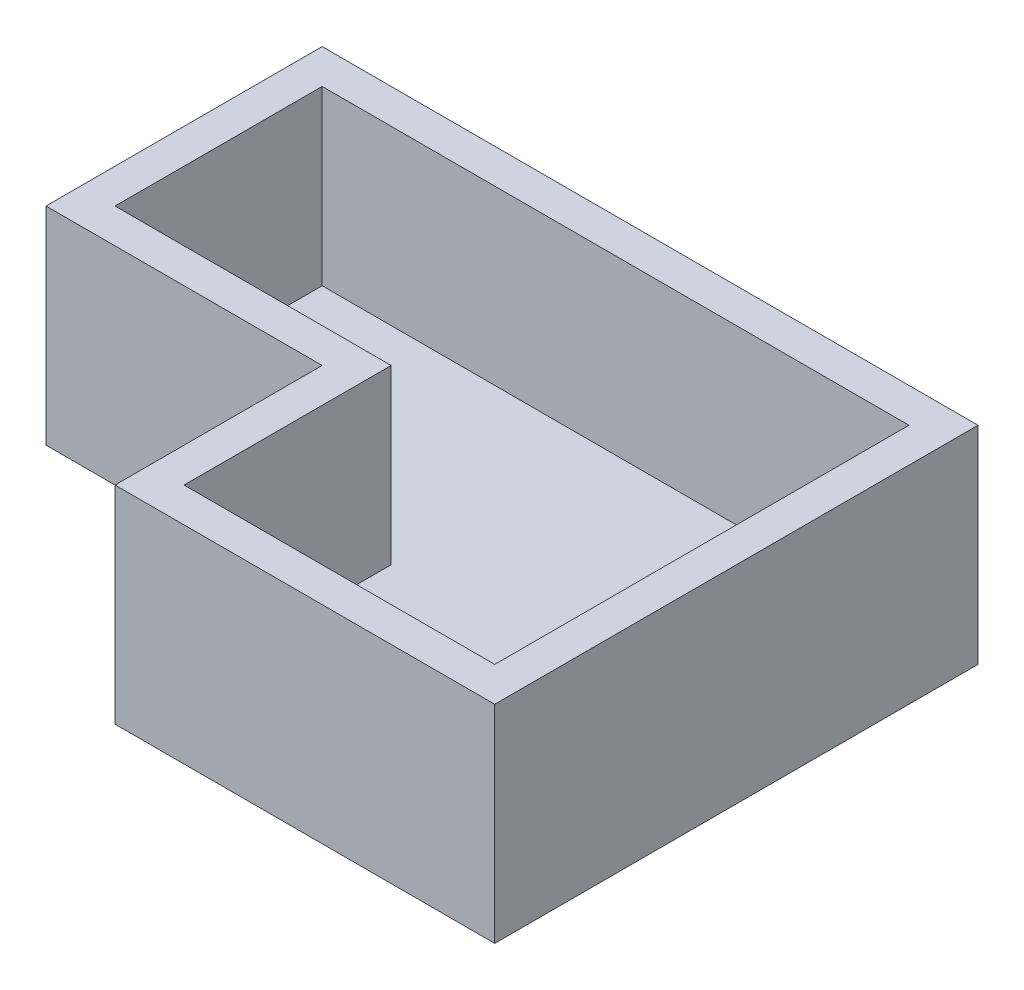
from build123d import *

# Parameters (mm, degrees)
EXTRUIR_L_MINA1_DEPTH   = 60
SALIENTE_EXTRUIR1_DEPTH = 10


with BuildPart() as part:
    # Croquis1 → Extruir-L_mina1 (new body)
    with BuildSketch(Plane(origin=(0, 0, 0), x_dir=(1, 0, 0), z_dir=(0, 1, 0))):
        Polygon((-79.570815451, 73.090128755), (110.429184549, 73.090128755), (110.429184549, -66.909871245), (0.429184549, -66.909871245), (0.429184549, -6.909871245), (-79.570815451, -6.909871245), align=None)
        Polygon((-69.570815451, 63.090128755), (100.429184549, 63.090128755), (100.429184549, -56.909871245), (10.429184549, -56.909871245), (10.429184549, 3.090128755), (-69.570815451, 3.090128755), align=None, mode=Mode.SUBTRACT)
    extrude(amount=EXTRUIR_L_MINA1_DEPTH)

    # Croquis2 → Saliente-Extruir1 (add)
    with BuildSketch(Plane(origin=(0, 0, 0), x_dir=(1, 0, 0), z_dir=(0, 1, 0))):
        Polygon((-69.570815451, 3.090128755), (10.429184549, 3.090128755), (10.429184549, -56.909871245), (100.429184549, -56.909871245), (100.429184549, 63.090128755), (-69.570815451, 63.090128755), align=None)
    extrude(amount=SALIENTE_EXTRUIR1_DEPTH)


solid = part.part
